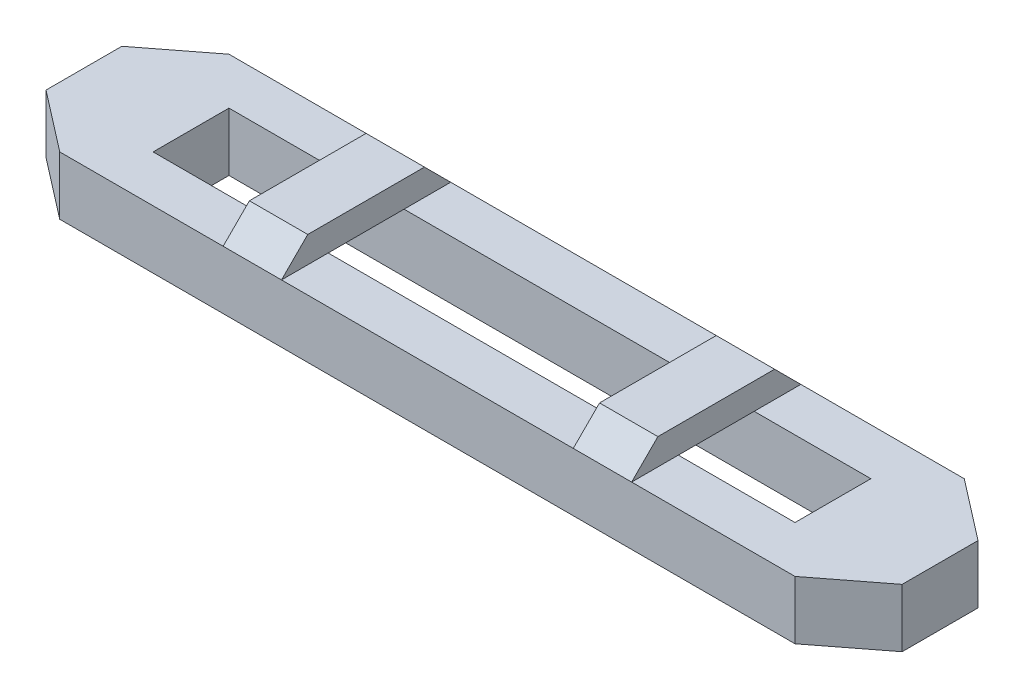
from build123d import *

# Parameters (mm, degrees)
CROQUIS1_W     = 110
CROQUIS1_H     = 13
EXTRUIR1_DEPTH = 10
EXTRUIR3_DEPTH = 5


with BuildPart() as part:
    # Croquis1 → Extruir1 (new body)
    with BuildSketch(Plane(origin=(0, 0, 0), x_dir=(1, 0, 0), z_dir=(0, 1, 0))):
        Polygon((-63, 14.5), (63, 14.5), (73.355967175, 6.5), (73.355967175, -6.5), (63, -14.5), (-63, -14.5), (-73.355967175, -6.5), (-73.355967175, 6.5), align=None)
        Rectangle(CROQUIS1_W, CROQUIS1_H, mode=Mode.SUBTRACT)
    extrude(amount=EXTRUIR1_DEPTH)

    # Croquis4 → Extruir3 (add, symmetric)
    with BuildSketch(Plane(origin=(30, 0, 0), x_dir=(0, 0, -1), z_dir=(1, 0, 0))):
        Polygon((-14.5, 10), (14.5, 10), (10, 14.5), (-10, 14.5), align=None)
    extruir3 = extrude(amount=EXTRUIR3_DEPTH, both=True)

    # Simetr_a1: Extruir3 across plane
    add(extruir3.mirror(Plane(origin=(0, 0, 0), x_dir=(0, 0, 1), z_dir=(1, 0, 0))))


solid = part.part
